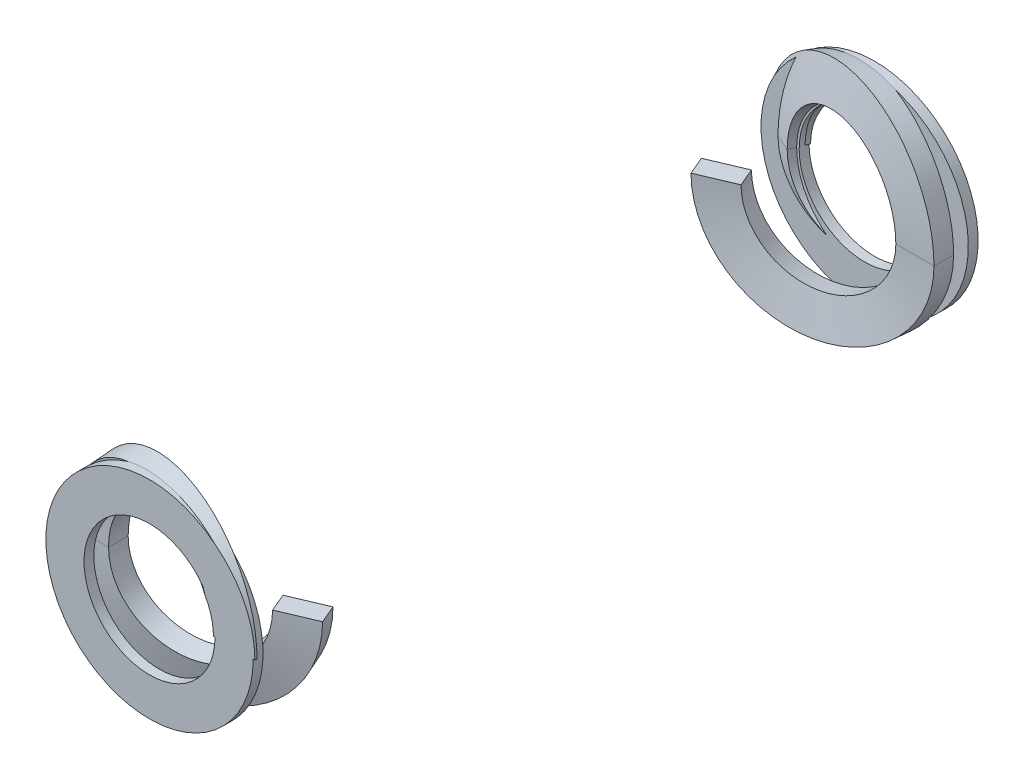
from build123d import *
from build123d.topology import SkipClean

# Parameters (mm, degrees)
SKETCH4_W               = 2.2058884
SKETCH4_H               = 1.134456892
SKETCH5_W               = 2.2058884
SKETCH5_H               = 1.134456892
REVOLVE3_ANGLE          = 180
SKETCH6_W               = 2.2058884
SKETCH6_H               = 1.134456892
REVOLVE4_ANGLE          = 180
REVOLVE8_ANGLE          = 90
SKETCH8_W               = 2.2058884
SKETCH8_H               = 1.134456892
REVOLVE6_ANGLE          = 180
SKETCH10_W              = 2.2058884
SKETCH10_H              = 1.134456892
REVOLVE7_ANGLE          = 180
REVOLVE9_ANGLE          = 90
CUT_EXTRUDE1_DEPTH      = 44.737336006
CUT_EXTRUDE1_DEPTH_BACK = 44.737336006
SKETCH9_W               = 12.7
SKETCH9_H               = 7.94119824
SKETCH9_H_2             = 3.97059912


with BuildPart() as part:
    # Sketch4 → Revolve2 (revolve)
    with BuildSketch(Plane(origin=(0, 0, 0), x_dir=(1, 0, 0), z_dir=(0, 1, 0)), mode=Mode.PRIVATE) as revolve2_sk:
        with Locations((-4.8898048, 41.91)):
            Rectangle(SKETCH4_W, SKETCH4_H)
        with Locations((4.8898048, 0)):
            Rectangle(SKETCH4_W, SKETCH4_H)
    revolve(revolve2_sk.sketch.rotate(Axis((0, 0, 0), (0, 0, -1)), 180), axis=Axis((0, 0, 0), (0, 0, -1)))



with BuildPart() as body_2:
    # Sketch5 → Revolve3 (revolve)
    with BuildSketch(Plane.XZ):
        with Locations((-4.8898048, -1.98529956)):
            Rectangle(SKETCH5_W, SKETCH5_H)
    revolve(axis=Axis((0, 0, -0.99264978), (0.1989460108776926, 0, -0.9800104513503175)), revolution_arc=REVOLVE3_ANGLE)

    # Sketch6 → Revolve4 (revolve)
    with BuildSketch(Plane(origin=(0, 0, 0), x_dir=(1, 0, 0), z_dir=(0, 1, 0))):
        with Locations((-4.8898048, 1.98529956)):
            Rectangle(SKETCH6_W, SKETCH6_H)
    revolve(axis=Axis((0, 0, -2.97794934), (0.1989460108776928, 0, 0.9800104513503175)), revolution_arc=REVOLVE4_ANGLE)


with BuildPart() as part_1:
    add(part.part)

    add(body_2.part)  # Revolve8 merges body 2
    # Sketch11 → Revolve8 (revolve)
    with BuildSketch(Plane(origin=(0, 0, 0), x_dir=(1, 0, 0), z_dir=(0, 1, 0))):
        Polygon((4.774655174, -0.567228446), (5.684256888, -0.952407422), (5.847364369, -0.567228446), align=None)
    revolve(axis=Axis((0, 0, 0), (-0.19894601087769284, 0, -0.9800104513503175)), revolution_arc=REVOLVE8_ANGLE)



with BuildPart() as body_2_2:
    # Sketch8 → Revolve6 (revolve)
    with BuildSketch(Plane(origin=(0, 0, 0), x_dir=(1, 0, 0), z_dir=(0, 1, 0))):
        with Locations((4.8898048, 39.92470044)):
            Rectangle(SKETCH8_W, SKETCH8_H)
    revolve(axis=Axis((0, 0, -40.91735022), (-0.19894601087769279, 0, 0.9800104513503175)), revolution_arc=REVOLVE6_ANGLE)

    # Sketch10 → Revolve7 (revolve)
    with BuildSketch(Plane(origin=(0, 0, 0), x_dir=(1, 0, 0), z_dir=(0, 1, 0))):
        with Locations((4.8898048, 39.92470044)):
            Rectangle(SKETCH10_W, SKETCH10_H)
    revolve(axis=Axis((0, 0, -38.93205066), (-0.19894601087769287, 0, -0.9800104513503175)), revolution_arc=REVOLVE7_ANGLE)


with BuildPart() as part_2:
    add(part_1.part)

    add(body_2_2.part)  # Revolve9 merges body 2 2
    # Sketch13 → Revolve9 (revolve)
    with BuildSketch(Plane(origin=(0, 0, 0), x_dir=(1, 0, 0), z_dir=(0, 1, 0))):
        Polygon((-3.932245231, 41.342771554), (-4.095352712, 40.957592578), (-5.004954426, 41.342771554), align=None)
    revolve(axis=Axis((0, 0, -41.91), (0.19894601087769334, 0, 0.9800104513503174)), revolution_arc=REVOLVE9_ANGLE)

    # Sketch9 → Cut-Extrude1 (cut, two sides: drawn at the far end of the back side and taken through both)
    with SkipClean():  # the faces are left unmerged after this step: merging them gives an invalid solid
        with BuildSketch(Plane(origin=(0, 0, 0), x_dir=(1, 0, 0), z_dir=(0, 1, 0)).offset(-CUT_EXTRUDE1_DEPTH_BACK)):
            with Locations((0, -3.97059912)):
                Rectangle(SKETCH9_W, SKETCH9_H)
            with Locations((0, 43.89529956)):
                Rectangle(SKETCH9_W, SKETCH9_H_2)
        extrude(amount=CUT_EXTRUDE1_DEPTH + CUT_EXTRUDE1_DEPTH_BACK, mode=Mode.SUBTRACT)


solid = part_2.part
